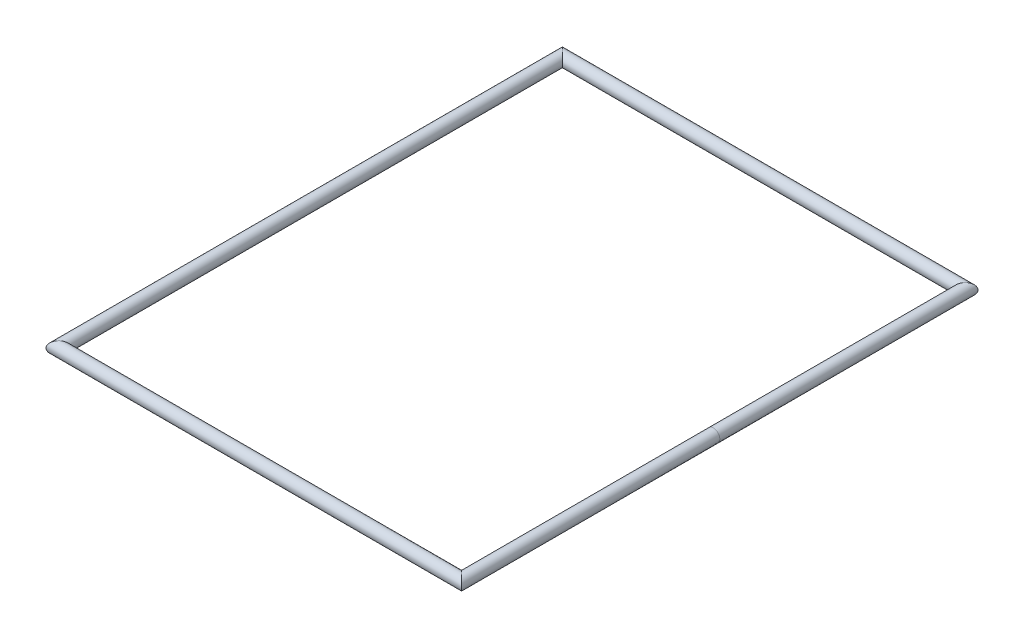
ISO-10303-21;
HEADER;
FILE_DESCRIPTION(('STEP AP214'),'2;1');
FILE_NAME('part.step','',(''),(''),'','','');
FILE_SCHEMA(('AUTOMOTIVE_DESIGN { 1 0 10303 214 1 1 1 1 }'));
ENDSEC;
DATA;
#1=APPLICATION_CONTEXT('core data for automotive mechanical design processes');
#2=APPLICATION_PROTOCOL_DEFINITION('international standard','automotive_design',2000,#1);
#3=PRODUCT_CONTEXT('',#1,'mechanical');
#4=PRODUCT('Part','Part','',(#3));
#5=PRODUCT_RELATED_PRODUCT_CATEGORY('part','',(#4));
#6=PRODUCT_DEFINITION_FORMATION('','',#4);
#7=PRODUCT_DEFINITION_CONTEXT('part definition',#1,'design');
#8=PRODUCT_DEFINITION('design','',#6,#7);
#9=PRODUCT_DEFINITION_SHAPE('','',#8);
#10=(LENGTH_UNIT() NAMED_UNIT(*) SI_UNIT(.MILLI.,.METRE.));
#11=(NAMED_UNIT(*) PLANE_ANGLE_UNIT() SI_UNIT($,.RADIAN.));
#12=(NAMED_UNIT(*) SI_UNIT($,.STERADIAN.) SOLID_ANGLE_UNIT());
#13=UNCERTAINTY_MEASURE_WITH_UNIT(LENGTH_MEASURE(1.E-05),#10,'distance_accuracy_value','');
#14=(GEOMETRIC_REPRESENTATION_CONTEXT(3) GLOBAL_UNCERTAINTY_ASSIGNED_CONTEXT((#13)) GLOBAL_UNIT_ASSIGNED_CONTEXT((#10,
#11,#12)) REPRESENTATION_CONTEXT('',''));
#15=CARTESIAN_POINT('',(0.,0.,0.));
#16=DIRECTION('',(0.,0.,1.));
#17=DIRECTION('',(1.,0.,0.));
#18=AXIS2_PLACEMENT_3D('',#15,#16,#17);
#19=CARTESIAN_POINT('',(-1221.,0.,-750.));
#20=DIRECTION('',(1.,0.,0.));
#21=DIRECTION('',(0.,0.,-1.));
#22=AXIS2_PLACEMENT_3D('',#19,#20,#21);
#23=CYLINDRICAL_SURFACE('',#22,19.);
#24=CARTESIAN_POINT('',(-1200.,0.,-750.));
#25=DIRECTION('',(0.707106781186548,0.,-0.707106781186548));
#26=DIRECTION('',(-0.707106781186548,0.,-0.707106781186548));
#27=AXIS2_PLACEMENT_3D('',#24,#25,#26);
#28=ELLIPSE('',#27,26.8700576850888,19.);
#29=CARTESIAN_POINT('',(-1219.,0.,-769.));
#30=VERTEX_POINT('',#29);
#31=EDGE_CURVE('E65',#30,#30,#28,.F.);
#32=ORIENTED_EDGE('',*,*,#31,.F.);
#33=EDGE_LOOP('',(#32));
#34=FACE_BOUND('',#33,.T.);
#35=CARTESIAN_POINT('',(0.,0.,-750.));
#36=DIRECTION('',(0.707106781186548,0.,0.707106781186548));
#37=DIRECTION('',(-0.707106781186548,0.,0.707106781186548));
#38=AXIS2_PLACEMENT_3D('',#35,#36,#37);
#39=ELLIPSE('',#38,26.8700576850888,19.);
#40=CARTESIAN_POINT('',(-19.,0.,-731.));
#41=VERTEX_POINT('',#40);
#42=EDGE_CURVE('E70',#41,#41,#39,.F.);
#43=ORIENTED_EDGE('',*,*,#42,.T.);
#44=EDGE_LOOP('',(#43));
#45=FACE_BOUND('',#44,.T.);
#46=ADVANCED_FACE('F34',(#34,#45),#23,.T.);
#47=CARTESIAN_POINT('',(0.,0.,-771.));
#48=DIRECTION('',(0.,0.,1.));
#49=DIRECTION('',(1.,0.,0.));
#50=AXIS2_PLACEMENT_3D('',#47,#48,#49);
#51=CYLINDRICAL_SURFACE('',#50,19.);
#52=ORIENTED_EDGE('',*,*,#42,.F.);
#53=EDGE_LOOP('',(#52));
#54=FACE_BOUND('',#53,.T.);
#55=CARTESIAN_POINT('',(0.,0.,0.));
#56=DIRECTION('',(0.,0.,1.));
#57=DIRECTION('',(1.,0.,0.));
#58=AXIS2_PLACEMENT_3D('',#55,#56,#57);
#59=CIRCLE('',#58,19.);
#60=CARTESIAN_POINT('',(19.,0.,0.));
#61=VERTEX_POINT('',#60);
#62=EDGE_CURVE('E37',#61,#61,#59,.T.);
#63=ORIENTED_EDGE('',*,*,#62,.F.);
#64=EDGE_LOOP('',(#63));
#65=FACE_BOUND('',#64,.T.);
#66=ADVANCED_FACE('F98',(#54,#65),#51,.T.);
#67=CARTESIAN_POINT('',(0.,0.,0.));
#68=DIRECTION('',(0.,0.,1.));
#69=DIRECTION('',(1.,0.,0.));
#70=AXIS2_PLACEMENT_3D('',#67,#68,#69);
#71=CYLINDRICAL_SURFACE('',#70,19.);
#72=ORIENTED_EDGE('',*,*,#62,.T.);
#73=EDGE_LOOP('',(#72));
#74=FACE_BOUND('',#73,.T.);
#75=CARTESIAN_POINT('',(-3.33066907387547E-13,0.,750.));
#76=DIRECTION('',(-0.707106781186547,0.,0.707106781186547));
#77=DIRECTION('',(-0.707106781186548,0.,-0.707106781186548));
#78=AXIS2_PLACEMENT_3D('',#75,#76,#77);
#79=ELLIPSE('',#78,26.8700576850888,19.);
#80=CARTESIAN_POINT('',(-19.0000000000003,0.,731.));
#81=VERTEX_POINT('',#80);
#82=EDGE_CURVE('E90',#81,#81,#79,.F.);
#83=ORIENTED_EDGE('',*,*,#82,.T.);
#84=EDGE_LOOP('',(#83));
#85=FACE_BOUND('',#84,.T.);
#86=ADVANCED_FACE('F95',(#74,#85),#71,.T.);
#87=CARTESIAN_POINT('',(-1200.,0.,771.));
#88=DIRECTION('',(0.,0.,-1.));
#89=DIRECTION('',(-1.,0.,0.));
#90=AXIS2_PLACEMENT_3D('',#87,#88,#89);
#91=CYLINDRICAL_SURFACE('',#90,19.);
#92=CARTESIAN_POINT('',(-1200.,0.,750.));
#93=DIRECTION('',(-0.707106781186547,0.,-0.707106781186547));
#94=DIRECTION('',(-0.707106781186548,0.,0.707106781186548));
#95=AXIS2_PLACEMENT_3D('',#92,#93,#94);
#96=ELLIPSE('',#95,26.8700576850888,19.);
#97=CARTESIAN_POINT('',(-1219.,0.,769.));
#98=VERTEX_POINT('',#97);
#99=EDGE_CURVE('E87',#98,#98,#96,.F.);
#100=ORIENTED_EDGE('',*,*,#99,.F.);
#101=EDGE_LOOP('',(#100));
#102=FACE_BOUND('',#101,.T.);
#103=ORIENTED_EDGE('',*,*,#31,.T.);
#104=EDGE_LOOP('',(#103));
#105=FACE_BOUND('',#104,.T.);
#106=ADVANCED_FACE('F106',(#102,#105),#91,.T.);
#107=CARTESIAN_POINT('',(20.9999999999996,0.,750.));
#108=DIRECTION('',(-1.,0.,0.));
#109=DIRECTION('',(0.,0.,1.));
#110=AXIS2_PLACEMENT_3D('',#107,#108,#109);
#111=CYLINDRICAL_SURFACE('',#110,19.);
#112=ORIENTED_EDGE('',*,*,#82,.F.);
#113=EDGE_LOOP('',(#112));
#114=FACE_BOUND('',#113,.T.);
#115=ORIENTED_EDGE('',*,*,#99,.T.);
#116=EDGE_LOOP('',(#115));
#117=FACE_BOUND('',#116,.T.);
#118=ADVANCED_FACE('F108',(#114,#117),#111,.T.);
#119=CLOSED_SHELL('',(#46,#66,#86,#106,#118));
#120=CARTESIAN_POINT('',(-1218.8,0.,-750.));
#121=DIRECTION('',(1.,0.,0.));
#122=DIRECTION('',(0.,0.,-1.));
#123=AXIS2_PLACEMENT_3D('',#120,#121,#122);
#124=CYLINDRICAL_SURFACE('',#123,17.);
#125=CARTESIAN_POINT('',(-1200.,0.,-750.));
#126=DIRECTION('',(0.707106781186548,0.,-0.707106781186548));
#127=DIRECTION('',(-0.707106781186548,0.,-0.707106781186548));
#128=AXIS2_PLACEMENT_3D('',#125,#126,#127);
#129=ELLIPSE('',#128,24.0416305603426,17.);
#130=CARTESIAN_POINT('',(-1217.,0.,-767.));
#131=VERTEX_POINT('',#130);
#132=EDGE_CURVE('E79',#131,#131,#129,.T.);
#133=ORIENTED_EDGE('',*,*,#132,.F.);
#134=EDGE_LOOP('',(#133));
#135=FACE_BOUND('',#134,.T.);
#136=CARTESIAN_POINT('',(0.,0.,-750.));
#137=DIRECTION('',(0.707106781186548,0.,0.707106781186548));
#138=DIRECTION('',(-0.707106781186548,0.,0.707106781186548));
#139=AXIS2_PLACEMENT_3D('',#136,#137,#138);
#140=ELLIPSE('',#139,24.0416305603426,17.);
#141=CARTESIAN_POINT('',(-17.,0.,-733.));
#142=VERTEX_POINT('',#141);
#143=EDGE_CURVE('E50',#142,#142,#140,.T.);
#144=ORIENTED_EDGE('',*,*,#143,.T.);
#145=EDGE_LOOP('',(#144));
#146=FACE_BOUND('',#145,.T.);
#147=ADVANCED_FACE('F120',(#135,#146),#124,.F.);
#148=CARTESIAN_POINT('',(0.,0.,-768.8));
#149=DIRECTION('',(0.,0.,1.));
#150=DIRECTION('',(1.,0.,0.));
#151=AXIS2_PLACEMENT_3D('',#148,#149,#150);
#152=CYLINDRICAL_SURFACE('',#151,17.);
#153=ORIENTED_EDGE('',*,*,#143,.F.);
#154=EDGE_LOOP('',(#153));
#155=FACE_BOUND('',#154,.T.);
#156=CARTESIAN_POINT('',(0.,0.,0.));
#157=DIRECTION('',(0.,0.,1.));
#158=DIRECTION('',(1.,0.,0.));
#159=AXIS2_PLACEMENT_3D('',#156,#157,#158);
#160=CIRCLE('',#159,17.);
#161=CARTESIAN_POINT('',(17.,0.,0.));
#162=VERTEX_POINT('',#161);
#163=EDGE_CURVE('E84',#162,#162,#160,.F.);
#164=ORIENTED_EDGE('',*,*,#163,.F.);
#165=EDGE_LOOP('',(#164));
#166=FACE_BOUND('',#165,.T.);
#167=ADVANCED_FACE('F122',(#155,#166),#152,.F.);
#168=CARTESIAN_POINT('',(0.,0.,0.));
#169=DIRECTION('',(0.,0.,1.));
#170=DIRECTION('',(1.,0.,0.));
#171=AXIS2_PLACEMENT_3D('',#168,#169,#170);
#172=CYLINDRICAL_SURFACE('',#171,17.);
#173=ORIENTED_EDGE('',*,*,#163,.T.);
#174=EDGE_LOOP('',(#173));
#175=FACE_BOUND('',#174,.T.);
#176=CARTESIAN_POINT('',(-3.33066907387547E-13,0.,750.));
#177=DIRECTION('',(-0.707106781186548,0.,0.707106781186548));
#178=DIRECTION('',(-0.707106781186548,0.,-0.707106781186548));
#179=AXIS2_PLACEMENT_3D('',#176,#177,#178);
#180=ELLIPSE('',#179,24.0416305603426,17.);
#181=CARTESIAN_POINT('',(-17.0000000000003,0.,733.));
#182=VERTEX_POINT('',#181);
#183=EDGE_CURVE('E43',#182,#182,#180,.T.);
#184=ORIENTED_EDGE('',*,*,#183,.T.);
#185=EDGE_LOOP('',(#184));
#186=FACE_BOUND('',#185,.T.);
#187=ADVANCED_FACE('F77',(#175,#186),#172,.F.);
#188=CARTESIAN_POINT('',(-1200.,0.,768.8));
#189=DIRECTION('',(0.,0.,-1.));
#190=DIRECTION('',(-1.,0.,0.));
#191=AXIS2_PLACEMENT_3D('',#188,#189,#190);
#192=CYLINDRICAL_SURFACE('',#191,17.);
#193=CARTESIAN_POINT('',(-1200.,0.,750.));
#194=DIRECTION('',(-0.707106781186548,0.,-0.707106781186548));
#195=DIRECTION('',(-0.707106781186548,0.,0.707106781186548));
#196=AXIS2_PLACEMENT_3D('',#193,#194,#195);
#197=ELLIPSE('',#196,24.0416305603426,17.);
#198=CARTESIAN_POINT('',(-1217.,0.,767.));
#199=VERTEX_POINT('',#198);
#200=EDGE_CURVE('E11',#199,#199,#197,.T.);
#201=ORIENTED_EDGE('',*,*,#200,.F.);
#202=EDGE_LOOP('',(#201));
#203=FACE_BOUND('',#202,.T.);
#204=ORIENTED_EDGE('',*,*,#132,.T.);
#205=EDGE_LOOP('',(#204));
#206=FACE_BOUND('',#205,.T.);
#207=ADVANCED_FACE('F127',(#203,#206),#192,.F.);
#208=CARTESIAN_POINT('',(18.7999999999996,0.,750.));
#209=DIRECTION('',(-1.,0.,0.));
#210=DIRECTION('',(0.,0.,1.));
#211=AXIS2_PLACEMENT_3D('',#208,#209,#210);
#212=CYLINDRICAL_SURFACE('',#211,17.);
#213=ORIENTED_EDGE('',*,*,#183,.F.);
#214=EDGE_LOOP('',(#213));
#215=FACE_BOUND('',#214,.T.);
#216=ORIENTED_EDGE('',*,*,#200,.T.);
#217=EDGE_LOOP('',(#216));
#218=FACE_BOUND('',#217,.T.);
#219=ADVANCED_FACE('F134',(#215,#218),#212,.F.);
#220=CLOSED_SHELL('',(#147,#167,#187,#207,#219));
#221=ORIENTED_CLOSED_SHELL('',*,#220,.T.);
#222=BREP_WITH_VOIDS('B2',#119,(#221));
#223=ADVANCED_BREP_SHAPE_REPRESENTATION('',(#18,#222),#14);
#224=SHAPE_DEFINITION_REPRESENTATION(#9,#223);
ENDSEC;
END-ISO-10303-21;
